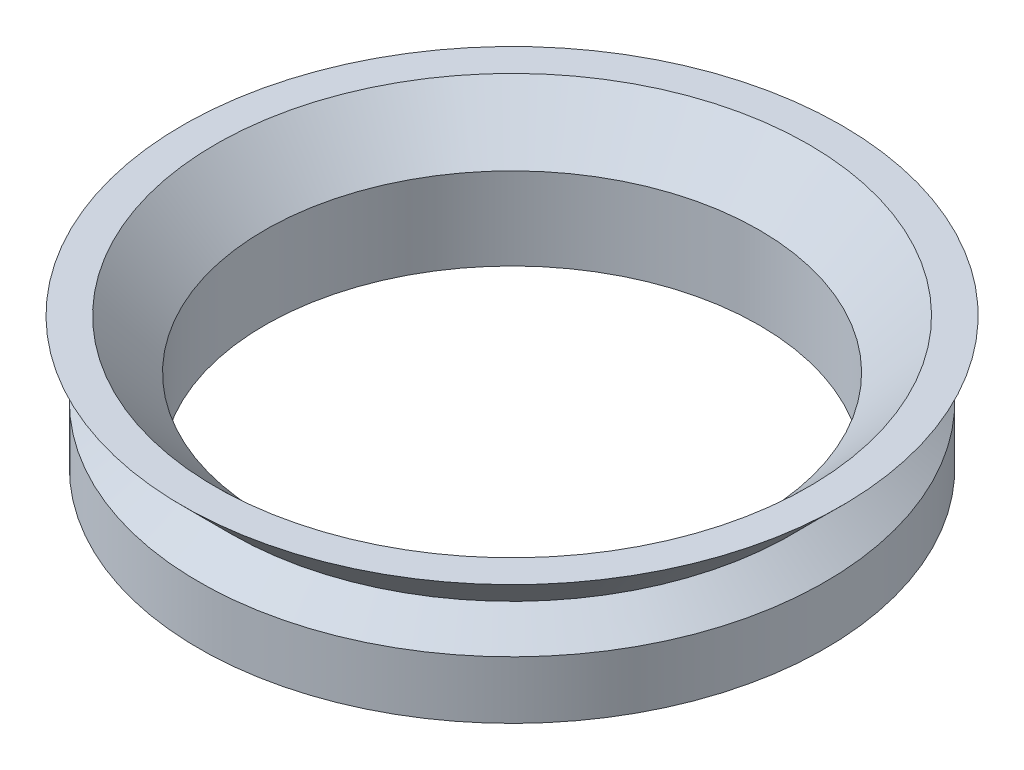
ISO-10303-21;
HEADER;
FILE_DESCRIPTION(('STEP AP214'),'2;1');
FILE_NAME('part.step','',(''),(''),'','','');
FILE_SCHEMA(('AUTOMOTIVE_DESIGN { 1 0 10303 214 1 1 1 1 }'));
ENDSEC;
DATA;
#1=APPLICATION_CONTEXT('core data for automotive mechanical design processes');
#2=APPLICATION_PROTOCOL_DEFINITION('international standard','automotive_design',2000,#1);
#3=PRODUCT_CONTEXT('',#1,'mechanical');
#4=PRODUCT('Part','Part','',(#3));
#5=PRODUCT_RELATED_PRODUCT_CATEGORY('part','',(#4));
#6=PRODUCT_DEFINITION_FORMATION('','',#4);
#7=PRODUCT_DEFINITION_CONTEXT('part definition',#1,'design');
#8=PRODUCT_DEFINITION('design','',#6,#7);
#9=PRODUCT_DEFINITION_SHAPE('','',#8);
#10=(LENGTH_UNIT() NAMED_UNIT(*) SI_UNIT(.MILLI.,.METRE.));
#11=(NAMED_UNIT(*) PLANE_ANGLE_UNIT() SI_UNIT($,.RADIAN.));
#12=(NAMED_UNIT(*) SI_UNIT($,.STERADIAN.) SOLID_ANGLE_UNIT());
#13=UNCERTAINTY_MEASURE_WITH_UNIT(LENGTH_MEASURE(1.E-05),#10,'distance_accuracy_value','');
#14=(GEOMETRIC_REPRESENTATION_CONTEXT(3) GLOBAL_UNCERTAINTY_ASSIGNED_CONTEXT((#13)) GLOBAL_UNIT_ASSIGNED_CONTEXT((#10,
#11,#12)) REPRESENTATION_CONTEXT('',''));
#15=CARTESIAN_POINT('',(0.,0.,0.));
#16=DIRECTION('',(0.,0.,1.));
#17=DIRECTION('',(1.,0.,0.));
#18=AXIS2_PLACEMENT_3D('',#15,#16,#17);
#19=CARTESIAN_POINT('',(15.,0.,0.));
#20=DIRECTION('',(0.,-1.,0.));
#21=DIRECTION('',(0.,0.,-1.));
#22=AXIS2_PLACEMENT_3D('',#19,#20,#21);
#23=PLANE('',#22);
#24=CARTESIAN_POINT('',(0.,0.,0.));
#25=DIRECTION('',(0.,-1.,0.));
#26=DIRECTION('',(0.,0.,-1.));
#27=AXIS2_PLACEMENT_3D('',#24,#25,#26);
#28=CIRCLE('',#27,19.);
#29=CARTESIAN_POINT('',(0.,0.,-19.));
#30=VERTEX_POINT('',#29);
#31=EDGE_CURVE('E10',#30,#30,#28,.T.);
#32=ORIENTED_EDGE('',*,*,#31,.T.);
#33=EDGE_LOOP('',(#32));
#34=FACE_BOUND('',#33,.T.);
#35=CARTESIAN_POINT('',(0.,0.,0.));
#36=DIRECTION('',(0.,-1.,0.));
#37=DIRECTION('',(0.,0.,-1.));
#38=AXIS2_PLACEMENT_3D('',#35,#36,#37);
#39=CIRCLE('',#38,15.);
#40=CARTESIAN_POINT('',(0.,0.,-15.));
#41=VERTEX_POINT('',#40);
#42=EDGE_CURVE('E55',#41,#41,#39,.T.);
#43=ORIENTED_EDGE('',*,*,#42,.F.);
#44=EDGE_LOOP('',(#43));
#45=FACE_BOUND('',#44,.T.);
#46=ADVANCED_FACE('F30',(#34,#45),#23,.T.);
#47=CARTESIAN_POINT('',(0.,-24.2488615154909,0.));
#48=DIRECTION('',(0.,-1.,0.));
#49=DIRECTION('',(0.,0.,-1.));
#50=AXIS2_PLACEMENT_3D('',#47,#48,#49);
#51=CYLINDRICAL_SURFACE('',#50,19.);
#52=CARTESIAN_POINT('',(0.,3.5,0.));
#53=DIRECTION('',(0.,-1.,0.));
#54=DIRECTION('',(0.,0.,-1.));
#55=AXIS2_PLACEMENT_3D('',#52,#53,#54);
#56=CIRCLE('',#55,19.);
#57=CARTESIAN_POINT('',(0.,3.5,-19.));
#58=VERTEX_POINT('',#57);
#59=EDGE_CURVE('E36',#58,#58,#56,.T.);
#60=ORIENTED_EDGE('',*,*,#59,.T.);
#61=EDGE_LOOP('',(#60));
#62=FACE_BOUND('',#61,.T.);
#63=ORIENTED_EDGE('',*,*,#31,.F.);
#64=EDGE_LOOP('',(#63));
#65=FACE_BOUND('',#64,.T.);
#66=ADVANCED_FACE('F63',(#62,#65),#51,.T.);
#67=CARTESIAN_POINT('',(0.,3.5,0.));
#68=DIRECTION('',(0.,-1.,0.));
#69=DIRECTION('',(0.,0.,-1.));
#70=AXIS2_PLACEMENT_3D('',#67,#68,#69);
#71=CONICAL_SURFACE('',#70,19.,0.927295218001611);
#72=CARTESIAN_POINT('',(0.,5.,0.));
#73=DIRECTION('',(0.,-1.,0.));
#74=DIRECTION('',(0.,0.,-1.));
#75=AXIS2_PLACEMENT_3D('',#72,#73,#74);
#76=CIRCLE('',#75,17.);
#77=CARTESIAN_POINT('',(0.,5.,-17.));
#78=VERTEX_POINT('',#77);
#79=EDGE_CURVE('E40',#78,#78,#76,.T.);
#80=ORIENTED_EDGE('',*,*,#79,.T.);
#81=EDGE_LOOP('',(#80));
#82=FACE_BOUND('',#81,.T.);
#83=ORIENTED_EDGE('',*,*,#59,.F.);
#84=EDGE_LOOP('',(#83));
#85=FACE_BOUND('',#84,.T.);
#86=ADVANCED_FACE('F67',(#82,#85),#71,.T.);
#87=CARTESIAN_POINT('',(0.,5.,0.));
#88=DIRECTION('',(0.,1.,0.));
#89=DIRECTION('',(0.,0.,1.));
#90=AXIS2_PLACEMENT_3D('',#87,#88,#89);
#91=CONICAL_SURFACE('',#90,17.,0.785398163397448);
#92=CARTESIAN_POINT('',(0.,8.,0.));
#93=DIRECTION('',(0.,-1.,0.));
#94=DIRECTION('',(0.,0.,-1.));
#95=AXIS2_PLACEMENT_3D('',#92,#93,#94);
#96=CIRCLE('',#95,20.);
#97=CARTESIAN_POINT('',(0.,8.,-20.));
#98=VERTEX_POINT('',#97);
#99=EDGE_CURVE('E44',#98,#98,#96,.T.);
#100=ORIENTED_EDGE('',*,*,#99,.T.);
#101=EDGE_LOOP('',(#100));
#102=FACE_BOUND('',#101,.T.);
#103=ORIENTED_EDGE('',*,*,#79,.F.);
#104=EDGE_LOOP('',(#103));
#105=FACE_BOUND('',#104,.T.);
#106=ADVANCED_FACE('F71',(#102,#105),#91,.T.);
#107=CARTESIAN_POINT('',(20.,8.,0.));
#108=DIRECTION('',(0.,1.,0.));
#109=DIRECTION('',(0.,0.,1.));
#110=AXIS2_PLACEMENT_3D('',#107,#108,#109);
#111=PLANE('',#110);
#112=CARTESIAN_POINT('',(0.,8.,0.));
#113=DIRECTION('',(0.,-1.,0.));
#114=DIRECTION('',(0.,0.,-1.));
#115=AXIS2_PLACEMENT_3D('',#112,#113,#114);
#116=CIRCLE('',#115,18.);
#117=CARTESIAN_POINT('',(0.,8.,-18.));
#118=VERTEX_POINT('',#117);
#119=EDGE_CURVE('E49',#118,#118,#116,.T.);
#120=ORIENTED_EDGE('',*,*,#119,.T.);
#121=EDGE_LOOP('',(#120));
#122=FACE_BOUND('',#121,.T.);
#123=ORIENTED_EDGE('',*,*,#99,.F.);
#124=EDGE_LOOP('',(#123));
#125=FACE_BOUND('',#124,.T.);
#126=ADVANCED_FACE('F78',(#122,#125),#111,.T.);
#127=CARTESIAN_POINT('',(0.,8.,0.));
#128=DIRECTION('',(0.,1.,0.));
#129=DIRECTION('',(0.,0.,1.));
#130=AXIS2_PLACEMENT_3D('',#127,#128,#129);
#131=CONICAL_SURFACE('',#130,18.,0.785398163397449);
#132=CARTESIAN_POINT('',(0.,5.,0.));
#133=DIRECTION('',(0.,-1.,0.));
#134=DIRECTION('',(0.,0.,-1.));
#135=AXIS2_PLACEMENT_3D('',#132,#133,#134);
#136=CIRCLE('',#135,15.);
#137=CARTESIAN_POINT('',(0.,5.,-15.));
#138=VERTEX_POINT('',#137);
#139=EDGE_CURVE('E52',#138,#138,#136,.T.);
#140=ORIENTED_EDGE('',*,*,#139,.T.);
#141=EDGE_LOOP('',(#140));
#142=FACE_BOUND('',#141,.T.);
#143=ORIENTED_EDGE('',*,*,#119,.F.);
#144=EDGE_LOOP('',(#143));
#145=FACE_BOUND('',#144,.T.);
#146=ADVANCED_FACE('F82',(#142,#145),#131,.F.);
#147=CARTESIAN_POINT('',(0.,-24.2488615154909,0.));
#148=DIRECTION('',(0.,-1.,0.));
#149=DIRECTION('',(0.,0.,-1.));
#150=AXIS2_PLACEMENT_3D('',#147,#148,#149);
#151=CYLINDRICAL_SURFACE('',#150,15.);
#152=ORIENTED_EDGE('',*,*,#42,.T.);
#153=EDGE_LOOP('',(#152));
#154=FACE_BOUND('',#153,.T.);
#155=ORIENTED_EDGE('',*,*,#139,.F.);
#156=EDGE_LOOP('',(#155));
#157=FACE_BOUND('',#156,.T.);
#158=ADVANCED_FACE('F59',(#154,#157),#151,.F.);
#159=CLOSED_SHELL('',(#46,#66,#86,#106,#126,#146,#158));
#160=MANIFOLD_SOLID_BREP('B2',#159);
#161=ADVANCED_BREP_SHAPE_REPRESENTATION('',(#18,#160),#14);
#162=SHAPE_DEFINITION_REPRESENTATION(#9,#161);
ENDSEC;
END-ISO-10303-21;
